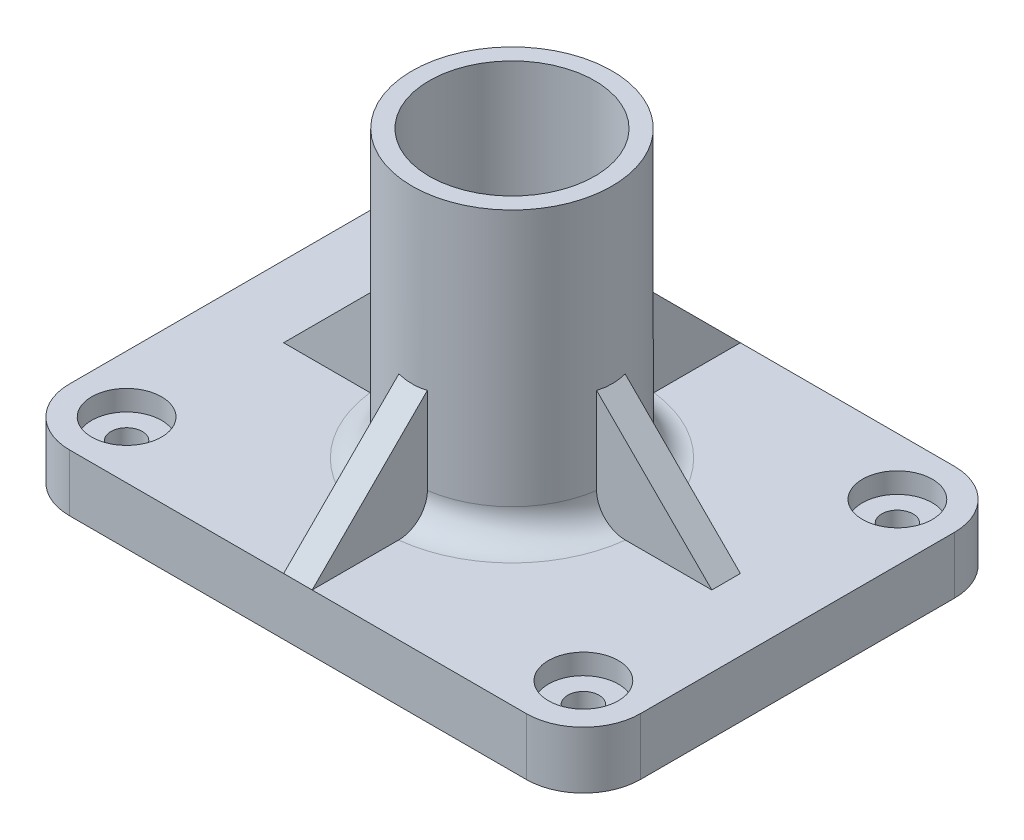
from build123d import *

# Parameters (mm, degrees)
EXTRUDE1_DEPTH                          = 10
CBORE_FOR_M5_HEX_HEAD_BOLT1_D           = 5.5
CBORE_FOR_M5_HEX_HEAD_BOLT1_CBORE_D     = 12.24
CBORE_FOR_M5_HEX_HEAD_BOLT1_CBORE_DEPTH = 3.58
SKETCH4_R                               = 17.5
SKETCH4_R_2                             = 14.5
EXTRUDE2_DEPTH                          = 50
RIB1_REACH                              = 88.639
SKETCH5_WALL_W                          = 203.56150576
SKETCH5_WALL_H                          = 5
CIRPATTERN1_COUNT                       = 4
FILLET1_R                               = 5


with BuildPart() as part:
    # Sketch1 → Extrude1 (new body)
    with BuildSketch(Plane(origin=(0, 0, 0), x_dir=(1, 0, 0), z_dir=(0, 1, 0))):
        with BuildLine():
            Line((-40, -37.5), (40, -37.5))
            ThreePointArc((40, -37.5), (47.071067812, -34.571067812), (50, -27.5))
            Line((50, -27.5), (50, 27.5))
            ThreePointArc((50, 27.5), (47.071067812, 34.571067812), (40, 37.5))
            Line((40, 37.5), (-40, 37.5))
            ThreePointArc((-40, 37.5), (-47.071067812, 34.571067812), (-50, 27.5))
            Line((-50, 27.5), (-50, -27.5))
            ThreePointArc((-50, -27.5), (-47.071067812, -34.571067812), (-40, -37.5))
        make_face()
    extrude(amount=EXTRUDE1_DEPTH)

    # CBORE for M5 Hex Head Bolt1 (through all)
    with Locations(Plane(origin=(0, 10, 0), x_dir=(-1, 0, 0), z_dir=(0, 1, 0))):
        with Locations((40, 27.5), (-40, -27.5), (-40, 27.5), (40, -27.5)):
            CounterBoreHole(CBORE_FOR_M5_HEX_HEAD_BOLT1_D / 2, CBORE_FOR_M5_HEX_HEAD_BOLT1_CBORE_D / 2, CBORE_FOR_M5_HEX_HEAD_BOLT1_CBORE_DEPTH)

    # Sketch4 → Extrude2 (add)
    with BuildSketch(Plane(origin=(0, 10, 0), x_dir=(-1, 0, 0), z_dir=(0, 1, 0))):
        with Locations(Location((0, 0, 0), (0, 0, 90))):
            Circle(SKETCH4_R)
        with Locations(Location((0, 0, 0), (0, 0, 90))):
            Circle(SKETCH4_R_2, mode=Mode.SUBTRACT)
    extrude(amount=EXTRUDE2_DEPTH)

    # Sketch5 wall → Rib1 (add, up to next)
    with BuildSketch(Plane(origin=(27.5, 20, 0), x_dir=(-0.707106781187, 0.707106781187, 0), z_dir=(-0.707106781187, -0.707106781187, 0)), mode=Mode.PRIVATE) as rib1_sk1:
        Rectangle(SKETCH5_WALL_W, SKETCH5_WALL_H)
    rib1_tool1 = extrude(rib1_sk1.sketch, amount=RIB1_REACH, mode=Mode.PRIVATE) - part.part
    rib1 = rib1_tool1.solids().sort_by_distance((27.5, 20, 0))[0]
    add(rib1)

    # CirPattern1: Rib1 ×4 about axis
    cirpattern1_axis = Axis((0, 0, 0), (0, 1, 0))
    for i in range(1, CIRPATTERN1_COUNT):
        add(rib1.rotate(cirpattern1_axis, i * 360 / CIRPATTERN1_COUNT))

    # Fillet1
    fillet1_edges = [part.edges().sort_by_distance(p)[0] for p in [
        (-12.374368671, 10, 12.374368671),
        (-12.374368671, 10, -12.374368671),
        (12.374368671, 10, -12.374368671),
        (12.374368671, 10, 12.374368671),
    ]]
    fillet(fillet1_edges, radius=FILLET1_R)


solid = part.part
